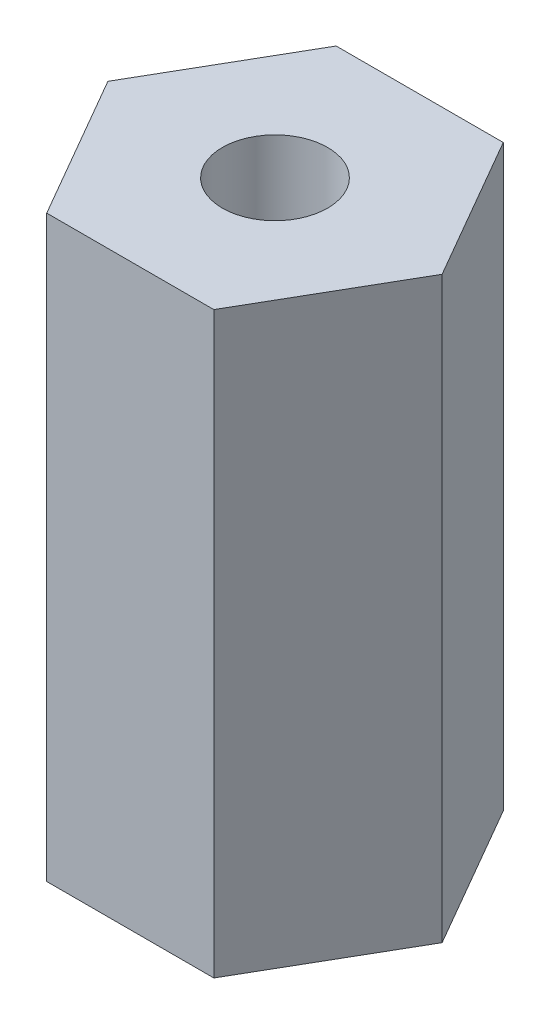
ISO-10303-21;
HEADER;
FILE_DESCRIPTION(('STEP AP214'),'2;1');
FILE_NAME('part.step','',(''),(''),'','','');
FILE_SCHEMA(('AUTOMOTIVE_DESIGN { 1 0 10303 214 1 1 1 1 }'));
ENDSEC;
DATA;
#1=APPLICATION_CONTEXT('core data for automotive mechanical design processes');
#2=APPLICATION_PROTOCOL_DEFINITION('international standard','automotive_design',2000,#1);
#3=PRODUCT_CONTEXT('',#1,'mechanical');
#4=PRODUCT('Part','Part','',(#3));
#5=PRODUCT_RELATED_PRODUCT_CATEGORY('part','',(#4));
#6=PRODUCT_DEFINITION_FORMATION('','',#4);
#7=PRODUCT_DEFINITION_CONTEXT('part definition',#1,'design');
#8=PRODUCT_DEFINITION('design','',#6,#7);
#9=PRODUCT_DEFINITION_SHAPE('','',#8);
#10=(LENGTH_UNIT() NAMED_UNIT(*) SI_UNIT(.MILLI.,.METRE.));
#11=(NAMED_UNIT(*) PLANE_ANGLE_UNIT() SI_UNIT($,.RADIAN.));
#12=(NAMED_UNIT(*) SI_UNIT($,.STERADIAN.) SOLID_ANGLE_UNIT());
#13=UNCERTAINTY_MEASURE_WITH_UNIT(LENGTH_MEASURE(1.E-05),#10,'distance_accuracy_value','');
#14=(GEOMETRIC_REPRESENTATION_CONTEXT(3) GLOBAL_UNCERTAINTY_ASSIGNED_CONTEXT((#13)) GLOBAL_UNIT_ASSIGNED_CONTEXT((#10,
#11,#12)) REPRESENTATION_CONTEXT('',''));
#15=CARTESIAN_POINT('',(0.,0.,0.));
#16=DIRECTION('',(0.,0.,1.));
#17=DIRECTION('',(1.,0.,0.));
#18=AXIS2_PLACEMENT_3D('',#15,#16,#17);
#19=CARTESIAN_POINT('',(3.17542648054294,11.,0.));
#20=DIRECTION('',(-0.866025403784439,0.,0.5));
#21=DIRECTION('',(0.5,0.,0.866025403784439));
#22=AXIS2_PLACEMENT_3D('',#19,#20,#21);
#23=PLANE('',#22);
#24=DIRECTION('',(-0.5,0.,-0.866025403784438));
#25=VECTOR('',#24,1.);
#26=CARTESIAN_POINT('',(3.17542648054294,0.,0.));
#27=LINE('',#26,#25);
#28=CARTESIAN_POINT('',(3.17542648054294,0.,0.));
#29=VERTEX_POINT('',#28);
#30=CARTESIAN_POINT('',(1.58771324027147,0.,-2.75));
#31=VERTEX_POINT('',#30);
#32=EDGE_CURVE('E120',#29,#31,#27,.T.);
#33=ORIENTED_EDGE('',*,*,#32,.T.);
#34=DIRECTION('',(0.,-1.,0.));
#35=VECTOR('',#34,1.);
#36=CARTESIAN_POINT('',(1.58771324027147,11.,-2.75));
#37=LINE('',#36,#35);
#38=CARTESIAN_POINT('',(1.58771324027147,11.,-2.75));
#39=VERTEX_POINT('',#38);
#40=EDGE_CURVE('E11',#39,#31,#37,.T.);
#41=ORIENTED_EDGE('',*,*,#40,.F.);
#42=DIRECTION('',(-0.5,0.,-0.866025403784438));
#43=VECTOR('',#42,1.);
#44=CARTESIAN_POINT('',(3.17542648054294,11.,0.));
#45=LINE('',#44,#43);
#46=CARTESIAN_POINT('',(3.17542648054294,11.,0.));
#47=VERTEX_POINT('',#46);
#48=EDGE_CURVE('E131',#47,#39,#45,.T.);
#49=ORIENTED_EDGE('',*,*,#48,.F.);
#50=DIRECTION('',(0.,-1.,0.));
#51=VECTOR('',#50,1.);
#52=CARTESIAN_POINT('',(3.17542648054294,11.,0.));
#53=LINE('',#52,#51);
#54=EDGE_CURVE('E116',#47,#29,#53,.T.);
#55=ORIENTED_EDGE('',*,*,#54,.T.);
#56=EDGE_LOOP('',(#33,#41,#49,#55));
#57=FACE_BOUND('',#56,.T.);
#58=ADVANCED_FACE('F36',(#57),#23,.F.);
#59=CARTESIAN_POINT('',(1.58771324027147,11.,-2.75));
#60=DIRECTION('',(0.,0.,1.));
#61=DIRECTION('',(1.,0.,0.));
#62=AXIS2_PLACEMENT_3D('',#59,#60,#61);
#63=PLANE('',#62);
#64=DIRECTION('',(-1.,0.,0.));
#65=VECTOR('',#64,1.);
#66=CARTESIAN_POINT('',(1.58771324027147,0.,-2.75));
#67=LINE('',#66,#65);
#68=CARTESIAN_POINT('',(-1.58771324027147,0.,-2.75));
#69=VERTEX_POINT('',#68);
#70=EDGE_CURVE('E123',#31,#69,#67,.T.);
#71=ORIENTED_EDGE('',*,*,#70,.T.);
#72=DIRECTION('',(0.,-1.,0.));
#73=VECTOR('',#72,1.);
#74=CARTESIAN_POINT('',(-1.58771324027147,11.,-2.75));
#75=LINE('',#74,#73);
#76=CARTESIAN_POINT('',(-1.58771324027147,11.,-2.75));
#77=VERTEX_POINT('',#76);
#78=EDGE_CURVE('E44',#77,#69,#75,.T.);
#79=ORIENTED_EDGE('',*,*,#78,.F.);
#80=DIRECTION('',(-1.,0.,0.));
#81=VECTOR('',#80,1.);
#82=CARTESIAN_POINT('',(1.58771324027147,11.,-2.75));
#83=LINE('',#82,#81);
#84=EDGE_CURVE('E89',#39,#77,#83,.T.);
#85=ORIENTED_EDGE('',*,*,#84,.F.);
#86=ORIENTED_EDGE('',*,*,#40,.T.);
#87=EDGE_LOOP('',(#71,#79,#85,#86));
#88=FACE_BOUND('',#87,.T.);
#89=ADVANCED_FACE('F156',(#88),#63,.F.);
#90=CARTESIAN_POINT('',(-1.58771324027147,11.,-2.75));
#91=DIRECTION('',(0.866025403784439,0.,0.5));
#92=DIRECTION('',(0.5,0.,-0.866025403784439));
#93=AXIS2_PLACEMENT_3D('',#90,#91,#92);
#94=PLANE('',#93);
#95=DIRECTION('',(-0.5,0.,0.866025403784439));
#96=VECTOR('',#95,1.);
#97=CARTESIAN_POINT('',(-1.58771324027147,0.,-2.75));
#98=LINE('',#97,#96);
#99=CARTESIAN_POINT('',(-3.17542648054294,0.,0.));
#100=VERTEX_POINT('',#99);
#101=EDGE_CURVE('E126',#69,#100,#98,.T.);
#102=ORIENTED_EDGE('',*,*,#101,.T.);
#103=DIRECTION('',(0.,-1.,0.));
#104=VECTOR('',#103,1.);
#105=CARTESIAN_POINT('',(-3.17542648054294,11.,0.));
#106=LINE('',#105,#104);
#107=CARTESIAN_POINT('',(-3.17542648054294,11.,0.));
#108=VERTEX_POINT('',#107);
#109=EDGE_CURVE('E111',#108,#100,#106,.T.);
#110=ORIENTED_EDGE('',*,*,#109,.F.);
#111=DIRECTION('',(-0.5,0.,0.866025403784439));
#112=VECTOR('',#111,1.);
#113=CARTESIAN_POINT('',(-1.58771324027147,11.,-2.75));
#114=LINE('',#113,#112);
#115=EDGE_CURVE('E102',#77,#108,#114,.T.);
#116=ORIENTED_EDGE('',*,*,#115,.F.);
#117=ORIENTED_EDGE('',*,*,#78,.T.);
#118=EDGE_LOOP('',(#102,#110,#116,#117));
#119=FACE_BOUND('',#118,.T.);
#120=ADVANCED_FACE('F137',(#119),#94,.F.);
#121=CARTESIAN_POINT('',(-3.17542648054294,11.,0.));
#122=DIRECTION('',(0.866025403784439,0.,-0.5));
#123=DIRECTION('',(-0.5,0.,-0.866025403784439));
#124=AXIS2_PLACEMENT_3D('',#121,#122,#123);
#125=PLANE('',#124);
#126=DIRECTION('',(0.5,0.,0.866025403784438));
#127=VECTOR('',#126,1.);
#128=CARTESIAN_POINT('',(-3.17542648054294,0.,0.));
#129=LINE('',#128,#127);
#130=CARTESIAN_POINT('',(-1.58771324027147,0.,2.75));
#131=VERTEX_POINT('',#130);
#132=EDGE_CURVE('E110',#100,#131,#129,.T.);
#133=ORIENTED_EDGE('',*,*,#132,.T.);
#134=DIRECTION('',(0.,-1.,0.));
#135=VECTOR('',#134,1.);
#136=CARTESIAN_POINT('',(-1.58771324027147,11.,2.75));
#137=LINE('',#136,#135);
#138=CARTESIAN_POINT('',(-1.58771324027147,11.,2.75));
#139=VERTEX_POINT('',#138);
#140=EDGE_CURVE('E107',#139,#131,#137,.T.);
#141=ORIENTED_EDGE('',*,*,#140,.F.);
#142=DIRECTION('',(0.5,0.,0.866025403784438));
#143=VECTOR('',#142,1.);
#144=CARTESIAN_POINT('',(-3.17542648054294,11.,0.));
#145=LINE('',#144,#143);
#146=EDGE_CURVE('E96',#108,#139,#145,.T.);
#147=ORIENTED_EDGE('',*,*,#146,.F.);
#148=ORIENTED_EDGE('',*,*,#109,.T.);
#149=EDGE_LOOP('',(#133,#141,#147,#148));
#150=FACE_BOUND('',#149,.T.);
#151=ADVANCED_FACE('F108',(#150),#125,.F.);
#152=CARTESIAN_POINT('',(-1.58771324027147,11.,2.75));
#153=DIRECTION('',(0.,0.,-1.));
#154=DIRECTION('',(-1.,0.,0.));
#155=AXIS2_PLACEMENT_3D('',#152,#153,#154);
#156=PLANE('',#155);
#157=DIRECTION('',(1.,0.,0.));
#158=VECTOR('',#157,1.);
#159=CARTESIAN_POINT('',(-1.58771324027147,0.,2.75));
#160=LINE('',#159,#158);
#161=CARTESIAN_POINT('',(1.58771324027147,0.,2.75));
#162=VERTEX_POINT('',#161);
#163=EDGE_CURVE('E75',#131,#162,#160,.T.);
#164=ORIENTED_EDGE('',*,*,#163,.T.);
#165=DIRECTION('',(0.,-1.,0.));
#166=VECTOR('',#165,1.);
#167=CARTESIAN_POINT('',(1.58771324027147,11.,2.75));
#168=LINE('',#167,#166);
#169=CARTESIAN_POINT('',(1.58771324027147,11.,2.75));
#170=VERTEX_POINT('',#169);
#171=EDGE_CURVE('E112',#170,#162,#168,.T.);
#172=ORIENTED_EDGE('',*,*,#171,.F.);
#173=DIRECTION('',(1.,0.,0.));
#174=VECTOR('',#173,1.);
#175=CARTESIAN_POINT('',(-1.58771324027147,11.,2.75));
#176=LINE('',#175,#174);
#177=EDGE_CURVE('E100',#139,#170,#176,.T.);
#178=ORIENTED_EDGE('',*,*,#177,.F.);
#179=ORIENTED_EDGE('',*,*,#140,.T.);
#180=EDGE_LOOP('',(#164,#172,#178,#179));
#181=FACE_BOUND('',#180,.T.);
#182=ADVANCED_FACE('F114',(#181),#156,.F.);
#183=CARTESIAN_POINT('',(1.58771324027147,11.,2.75));
#184=DIRECTION('',(-0.866025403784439,0.,-0.5));
#185=DIRECTION('',(-0.5,0.,0.866025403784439));
#186=AXIS2_PLACEMENT_3D('',#183,#184,#185);
#187=PLANE('',#186);
#188=DIRECTION('',(0.5,0.,-0.866025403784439));
#189=VECTOR('',#188,1.);
#190=CARTESIAN_POINT('',(1.58771324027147,0.,2.75));
#191=LINE('',#190,#189);
#192=EDGE_CURVE('E81',#162,#29,#191,.T.);
#193=ORIENTED_EDGE('',*,*,#192,.T.);
#194=ORIENTED_EDGE('',*,*,#54,.F.);
#195=DIRECTION('',(0.5,0.,-0.866025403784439));
#196=VECTOR('',#195,1.);
#197=CARTESIAN_POINT('',(1.58771324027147,11.,2.75));
#198=LINE('',#197,#196);
#199=EDGE_CURVE('E52',#170,#47,#198,.T.);
#200=ORIENTED_EDGE('',*,*,#199,.F.);
#201=ORIENTED_EDGE('',*,*,#171,.T.);
#202=EDGE_LOOP('',(#193,#194,#200,#201));
#203=FACE_BOUND('',#202,.T.);
#204=ADVANCED_FACE('F144',(#203),#187,.F.);
#205=CARTESIAN_POINT('',(0.,11.,0.));
#206=DIRECTION('',(0.,1.,0.));
#207=DIRECTION('',(0.,0.,1.));
#208=AXIS2_PLACEMENT_3D('',#205,#206,#207);
#209=PLANE('',#208);
#210=CARTESIAN_POINT('',(0.,11.,0.));
#211=DIRECTION('',(0.,1.,0.));
#212=DIRECTION('',(0.,0.,1.));
#213=AXIS2_PLACEMENT_3D('',#210,#211,#212);
#214=CIRCLE('',#213,1.);
#215=CARTESIAN_POINT('',(0.,11.,1.));
#216=VERTEX_POINT('',#215);
#217=EDGE_CURVE('E213',#216,#216,#214,.T.);
#218=ORIENTED_EDGE('',*,*,#217,.F.);
#219=EDGE_LOOP('',(#218));
#220=FACE_BOUND('',#219,.T.);
#221=ORIENTED_EDGE('',*,*,#48,.T.);
#222=ORIENTED_EDGE('',*,*,#84,.T.);
#223=ORIENTED_EDGE('',*,*,#115,.T.);
#224=ORIENTED_EDGE('',*,*,#146,.T.);
#225=ORIENTED_EDGE('',*,*,#177,.T.);
#226=ORIENTED_EDGE('',*,*,#199,.T.);
#227=EDGE_LOOP('',(#221,#222,#223,#224,#225,#226));
#228=FACE_BOUND('',#227,.T.);
#229=ADVANCED_FACE('F98',(#220,#228),#209,.T.);
#230=CARTESIAN_POINT('',(0.,0.,0.));
#231=DIRECTION('',(0.,1.,0.));
#232=DIRECTION('',(0.,0.,1.));
#233=AXIS2_PLACEMENT_3D('',#230,#231,#232);
#234=PLANE('',#233);
#235=CARTESIAN_POINT('',(0.,0.,0.));
#236=DIRECTION('',(0.,1.,0.));
#237=DIRECTION('',(0.,0.,1.));
#238=AXIS2_PLACEMENT_3D('',#235,#236,#237);
#239=CIRCLE('',#238,1.);
#240=CARTESIAN_POINT('',(0.,0.,1.));
#241=VERTEX_POINT('',#240);
#242=EDGE_CURVE('E124',#241,#241,#239,.T.);
#243=ORIENTED_EDGE('',*,*,#242,.T.);
#244=EDGE_LOOP('',(#243));
#245=FACE_BOUND('',#244,.T.);
#246=ORIENTED_EDGE('',*,*,#32,.F.);
#247=ORIENTED_EDGE('',*,*,#192,.F.);
#248=ORIENTED_EDGE('',*,*,#163,.F.);
#249=ORIENTED_EDGE('',*,*,#132,.F.);
#250=ORIENTED_EDGE('',*,*,#101,.F.);
#251=ORIENTED_EDGE('',*,*,#70,.F.);
#252=EDGE_LOOP('',(#246,#247,#248,#249,#250,#251));
#253=FACE_BOUND('',#252,.T.);
#254=ADVANCED_FACE('F140',(#245,#253),#234,.F.);
#255=CARTESIAN_POINT('',(0.,0.,0.));
#256=DIRECTION('',(0.,1.,0.));
#257=DIRECTION('',(0.,0.,1.));
#258=AXIS2_PLACEMENT_3D('',#255,#256,#257);
#259=CYLINDRICAL_SURFACE('',#258,1.);
#260=ORIENTED_EDGE('',*,*,#242,.F.);
#261=EDGE_LOOP('',(#260));
#262=FACE_BOUND('',#261,.T.);
#263=ORIENTED_EDGE('',*,*,#217,.T.);
#264=EDGE_LOOP('',(#263));
#265=FACE_BOUND('',#264,.T.);
#266=ADVANCED_FACE('F193',(#262,#265),#259,.F.);
#267=CLOSED_SHELL('',(#58,#89,#120,#151,#182,#204,#229,#254,#266));
#268=MANIFOLD_SOLID_BREP('B2',#267);
#269=ADVANCED_BREP_SHAPE_REPRESENTATION('',(#18,#268),#14);
#270=SHAPE_DEFINITION_REPRESENTATION(#9,#269);
ENDSEC;
END-ISO-10303-21;
